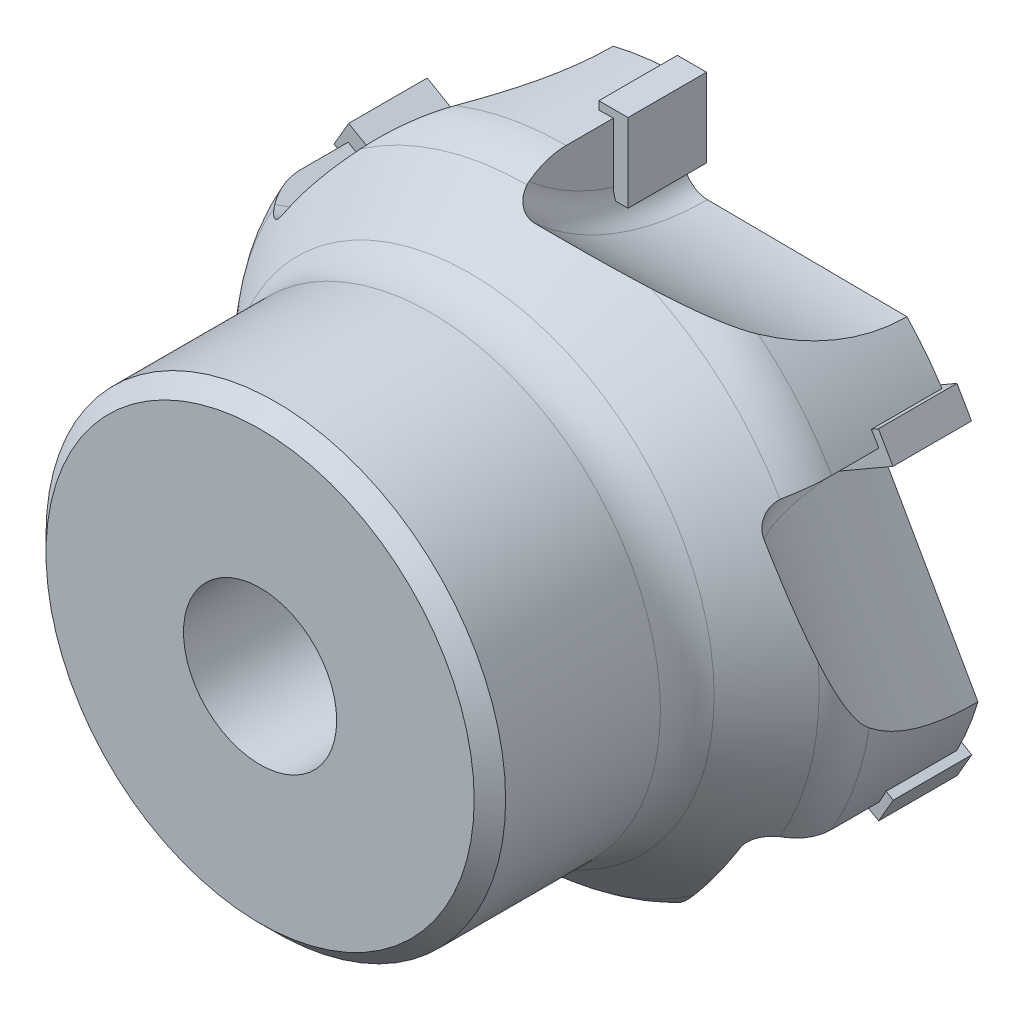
from build123d import *

# Parameters (mm, degrees)
GOUJURE_ANGLE       = 90
ESQPLAQUETTE_W      = 10
ESQPLAQUETTE_H      = 10
PLAQUETTE_DEPTH     = 1.858736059
REP_COUNT           = 6
REP_ANGLE           = 300
REP_PLAQUETTE_COUNT = 6


with BuildPart() as part:
    # EsqCorps → CorpsOutil (revolve)
    with BuildSketch(Plane(origin=(0, 0, 0), x_dir=(0, 0, -1), z_dir=(1, 0, 0)), mode=Mode.PRIVATE) as corpsoutil_sk:
        with BuildLine():
            Line((-1, 11.75), (-1, 39))
            Line((-1, 39), (-16, 39))
            ThreePointArc((-16, 39), (-18.667757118, 38.529602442), (-21.013743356, 37.175146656))
            Line((-21.013743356, 37.175146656), (-28.283789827, 31.074853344))
            ThreePointArc((-28.283789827, 31.074853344), (-30.629776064, 29.720397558), (-33.297533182, 29.25))
            Line((-33.297533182, 29.25), (-53, 29.25))
            Line((-53, 29.25), (-55, 27.25))
            Line((-55, 27.25), (-55, 9.75))
            Line((-55, 9.75), (-3, 9.75))
            Line((-3, 9.75), (-1, 11.75))
        make_face()
    revolve(corpsoutil_sk.sketch.rotate(Axis((0, 0, 1.430245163), (0, 0, -1)), 90), axis=Axis((0, 0, 1.430245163), (0, 0, -1)))

    # EsqGoujure → Goujure (revolve, cut)
    with BuildSketch(Plane(origin=(0, 0, 1), x_dir=(-1, 0, 0), z_dir=(0, 0, -1))):
        with BuildLine():
            Line((0.03, 39.99998875), (0.03, 29.99998875))
            ThreePointArc((0.03, 29.99998875), (-0.84027092, 27.887110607), (-2.946169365, 27.000083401))
            Line((-2.946169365, 27.000083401), (-29.705710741, 26.787511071))
            ThreePointArc((-29.705710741, 26.787511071), (-16.242054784, 36.554010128), (0.03, 39.99998875))
        make_face()
    goujure = revolve(axis=Axis((98.289260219, 59.99998875, 1), (-1, 0, 0)), revolution_arc=GOUJURE_ANGLE, mode=Mode.SUBTRACT)

    # EsqPlaquette → Plaquette (add, symmetric)
    with BuildSketch(Plane(origin=(-0.03, 0, 0), x_dir=(0, 0, -1), z_dir=(1, 0, 0))):
        with Locations((-5, 34.999988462)):
            Rectangle(ESQPLAQUETTE_W, ESQPLAQUETTE_H)
    plaquette = extrude(amount=PLAQUETTE_DEPTH, both=True)

    # Rep: Goujure ×6 about axis
    rep_axis = Axis((0, 0, -0.097382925), (0, 0, 1))
    for i in range(1, REP_COUNT):
        add(goujure.rotate(rep_axis, i * REP_ANGLE / (REP_COUNT - 1)), mode=Mode.SUBTRACT)

    # Rep_Plaquette: Plaquette ×6 about axis
    rep_plaquette_axis = Axis((0, 0, 0), (0, 0, 1))
    for i in range(1, REP_PLAQUETTE_COUNT):
        add(plaquette.rotate(rep_plaquette_axis, i * 360 / REP_PLAQUETTE_COUNT))


solid = part.part
